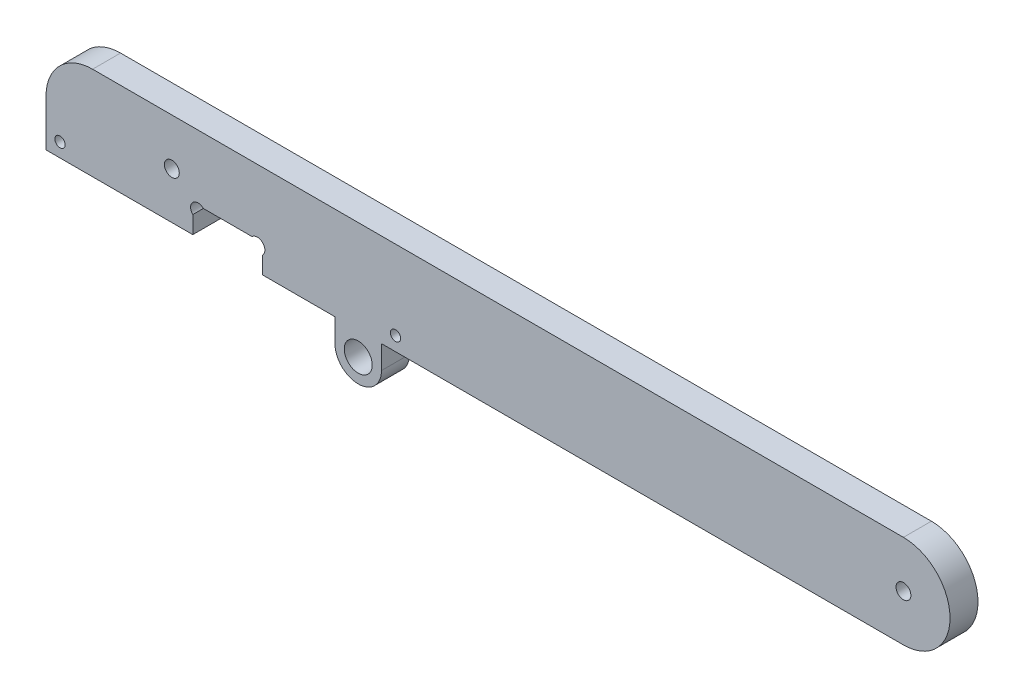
from build123d import *

# Parameters (mm, degrees)
ESQUISSE1_R        = 1.1
ESQUISSE1_R_2      = 1.6
ESQUISSE1_R_3      = 3
BOSS_EXTRU_1_DEPTH = 6


with BuildPart() as part:
    # Esquisse1 → Boss.-Extru.1 (new body)
    with BuildSketch(Plane.XY):
        with BuildLine():
            Line((10, 10), (184, 10))
            ThreePointArc((184, 10), (194, 0), (184, -10))
            Line((184, -10), (72, -10))
            Line((72, -10), (72, -15))
            ThreePointArc((72, -15), (67, -20), (62, -15))
            Line((62, -15), (62, -10))
            Line((62, -10), (46.5, -10))
            Line((46.5, -10), (46.5, -6.2627417))
            ThreePointArc((46.5, -6.2627417), (46.5, -4), (44.2372583, -4))
            Line((44.2372583, -4), (33.7627417, -4))
            ThreePointArc((33.7627417, -4), (31.5, -4), (31.5, -6.2627417))
            Line((31.5, -6.2627417), (31.5, -10))
            Line((31.5, -10), (0, -10))
            Line((0, -10), (0, 0))
            ThreePointArc((0, 0), (2.928932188, 7.071067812), (10, 10))
        make_face()
        with Locations((3, -7)):
            Circle(ESQUISSE1_R, mode=Mode.SUBTRACT)
        with Locations((27, 0)):
            Circle(ESQUISSE1_R_2, mode=Mode.SUBTRACT)
        with Locations((184, 0)):
            Circle(ESQUISSE1_R_2, mode=Mode.SUBTRACT)
        with Locations((67, -15)):
            Circle(ESQUISSE1_R_3, mode=Mode.SUBTRACT)
        with Locations((75, -7)):
            Circle(ESQUISSE1_R, mode=Mode.SUBTRACT)
    extrude(amount=BOSS_EXTRU_1_DEPTH)


solid = part.part
